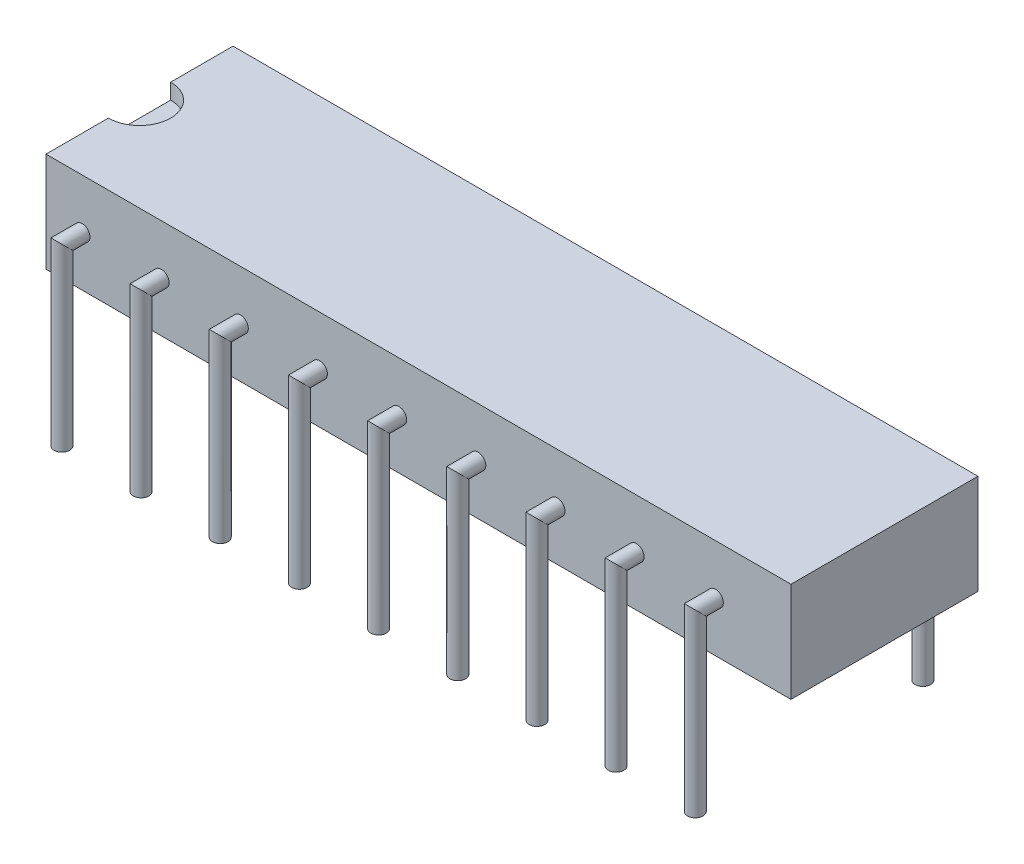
ISO-10303-21;
HEADER;
FILE_DESCRIPTION(('STEP AP214'),'2;1');
FILE_NAME('part.step','',(''),(''),'','','');
FILE_SCHEMA(('AUTOMOTIVE_DESIGN { 1 0 10303 214 1 1 1 1 }'));
ENDSEC;
DATA;
#1=APPLICATION_CONTEXT('core data for automotive mechanical design processes');
#2=APPLICATION_PROTOCOL_DEFINITION('international standard','automotive_design',2000,#1);
#3=PRODUCT_CONTEXT('',#1,'mechanical');
#4=PRODUCT('Part','Part','',(#3));
#5=PRODUCT_RELATED_PRODUCT_CATEGORY('part','',(#4));
#6=PRODUCT_DEFINITION_FORMATION('','',#4);
#7=PRODUCT_DEFINITION_CONTEXT('part definition',#1,'design');
#8=PRODUCT_DEFINITION('design','',#6,#7);
#9=PRODUCT_DEFINITION_SHAPE('','',#8);
#10=(LENGTH_UNIT() NAMED_UNIT(*) SI_UNIT(.MILLI.,.METRE.));
#11=(NAMED_UNIT(*) PLANE_ANGLE_UNIT() SI_UNIT($,.RADIAN.));
#12=(NAMED_UNIT(*) SI_UNIT($,.STERADIAN.) SOLID_ANGLE_UNIT());
#13=UNCERTAINTY_MEASURE_WITH_UNIT(LENGTH_MEASURE(1.E-05),#10,'distance_accuracy_value','');
#14=(GEOMETRIC_REPRESENTATION_CONTEXT(3) GLOBAL_UNCERTAINTY_ASSIGNED_CONTEXT((#13)) GLOBAL_UNIT_ASSIGNED_CONTEXT((#10,
#11,#12)) REPRESENTATION_CONTEXT('',''));
#15=CARTESIAN_POINT('',(0.,0.,0.));
#16=DIRECTION('',(0.,0.,1.));
#17=DIRECTION('',(1.,0.,0.));
#18=AXIS2_PLACEMENT_3D('',#15,#16,#17);
#19=CARTESIAN_POINT('',(23.9,3.2,3.));
#20=DIRECTION('',(0.,0.,-1.));
#21=DIRECTION('',(-1.,0.,0.));
#22=AXIS2_PLACEMENT_3D('',#19,#20,#21);
#23=PLANE('',#22);
#24=CARTESIAN_POINT('',(18.94,1.6,3.));
#25=DIRECTION('',(0.,0.,-1.));
#26=DIRECTION('',(-1.,0.,0.));
#27=AXIS2_PLACEMENT_3D('',#24,#25,#26);
#28=CIRCLE('',#27,0.25);
#29=CARTESIAN_POINT('',(18.69,1.6,3.));
#30=VERTEX_POINT('',#29);
#31=EDGE_CURVE('E56',#30,#30,#28,.F.);
#32=ORIENTED_EDGE('',*,*,#31,.F.);
#33=EDGE_LOOP('',(#32));
#34=FACE_BOUND('',#33,.T.);
#35=CARTESIAN_POINT('',(13.86,1.6,3.));
#36=DIRECTION('',(0.,0.,-1.));
#37=DIRECTION('',(-1.,0.,0.));
#38=AXIS2_PLACEMENT_3D('',#35,#36,#37);
#39=CIRCLE('',#38,0.25);
#40=CARTESIAN_POINT('',(13.61,1.6,3.));
#41=VERTEX_POINT('',#40);
#42=EDGE_CURVE('E162',#41,#41,#39,.F.);
#43=ORIENTED_EDGE('',*,*,#42,.F.);
#44=EDGE_LOOP('',(#43));
#45=FACE_BOUND('',#44,.T.);
#46=CARTESIAN_POINT('',(8.78,1.6,3.));
#47=DIRECTION('',(0.,0.,-1.));
#48=DIRECTION('',(-1.,0.,0.));
#49=AXIS2_PLACEMENT_3D('',#46,#47,#48);
#50=CIRCLE('',#49,0.25);
#51=CARTESIAN_POINT('',(8.53,1.6,3.));
#52=VERTEX_POINT('',#51);
#53=EDGE_CURVE('E156',#52,#52,#50,.F.);
#54=ORIENTED_EDGE('',*,*,#53,.F.);
#55=EDGE_LOOP('',(#54));
#56=FACE_BOUND('',#55,.T.);
#57=CARTESIAN_POINT('',(3.7,1.6,3.));
#58=DIRECTION('',(0.,0.,-1.));
#59=DIRECTION('',(-1.,0.,0.));
#60=AXIS2_PLACEMENT_3D('',#57,#58,#59);
#61=CIRCLE('',#60,0.25);
#62=CARTESIAN_POINT('',(3.45,1.6,3.));
#63=VERTEX_POINT('',#62);
#64=EDGE_CURVE('E150',#63,#63,#61,.F.);
#65=ORIENTED_EDGE('',*,*,#64,.F.);
#66=EDGE_LOOP('',(#65));
#67=FACE_BOUND('',#66,.T.);
#68=DIRECTION('',(0.,-1.,0.));
#69=VECTOR('',#68,1.);
#70=CARTESIAN_POINT('',(0.,3.2,3.));
#71=LINE('',#70,#69);
#72=CARTESIAN_POINT('',(0.,3.2,3.));
#73=VERTEX_POINT('',#72);
#74=CARTESIAN_POINT('',(0.,0.,3.));
#75=VERTEX_POINT('',#74);
#76=EDGE_CURVE('E186',#73,#75,#71,.T.);
#77=ORIENTED_EDGE('',*,*,#76,.T.);
#78=DIRECTION('',(-1.,0.,0.));
#79=VECTOR('',#78,1.);
#80=CARTESIAN_POINT('',(23.9,0.,3.));
#81=LINE('',#80,#79);
#82=CARTESIAN_POINT('',(23.9,0.,3.));
#83=VERTEX_POINT('',#82);
#84=EDGE_CURVE('E144',#83,#75,#81,.T.);
#85=ORIENTED_EDGE('',*,*,#84,.F.);
#86=DIRECTION('',(0.,-1.,0.));
#87=VECTOR('',#86,1.);
#88=CARTESIAN_POINT('',(23.9,3.2,3.));
#89=LINE('',#88,#87);
#90=CARTESIAN_POINT('',(23.9,3.2,3.));
#91=VERTEX_POINT('',#90);
#92=EDGE_CURVE('E124',#91,#83,#89,.T.);
#93=ORIENTED_EDGE('',*,*,#92,.F.);
#94=DIRECTION('',(-1.,0.,0.));
#95=VECTOR('',#94,1.);
#96=CARTESIAN_POINT('',(23.9,3.2,3.));
#97=LINE('',#96,#95);
#98=EDGE_CURVE('E137',#91,#73,#97,.T.);
#99=ORIENTED_EDGE('',*,*,#98,.T.);
#100=EDGE_LOOP('',(#77,#85,#93,#99));
#101=FACE_BOUND('',#100,.T.);
#102=CARTESIAN_POINT('',(1.16,1.6,3.));
#103=DIRECTION('',(0.,0.,-1.));
#104=DIRECTION('',(-1.,0.,0.));
#105=AXIS2_PLACEMENT_3D('',#102,#103,#104);
#106=CIRCLE('',#105,0.25);
#107=CARTESIAN_POINT('',(0.91,1.6,3.));
#108=VERTEX_POINT('',#107);
#109=EDGE_CURVE('E147',#108,#108,#106,.F.);
#110=ORIENTED_EDGE('',*,*,#109,.F.);
#111=EDGE_LOOP('',(#110));
#112=FACE_BOUND('',#111,.T.);
#113=CARTESIAN_POINT('',(6.24,1.6,3.));
#114=DIRECTION('',(0.,0.,-1.));
#115=DIRECTION('',(-1.,0.,0.));
#116=AXIS2_PLACEMENT_3D('',#113,#114,#115);
#117=CIRCLE('',#116,0.25);
#118=CARTESIAN_POINT('',(5.99,1.6,3.));
#119=VERTEX_POINT('',#118);
#120=EDGE_CURVE('E153',#119,#119,#117,.F.);
#121=ORIENTED_EDGE('',*,*,#120,.F.);
#122=EDGE_LOOP('',(#121));
#123=FACE_BOUND('',#122,.T.);
#124=CARTESIAN_POINT('',(11.32,1.6,3.));
#125=DIRECTION('',(0.,0.,-1.));
#126=DIRECTION('',(-1.,0.,0.));
#127=AXIS2_PLACEMENT_3D('',#124,#125,#126);
#128=CIRCLE('',#127,0.25);
#129=CARTESIAN_POINT('',(11.07,1.6,3.));
#130=VERTEX_POINT('',#129);
#131=EDGE_CURVE('E159',#130,#130,#128,.F.);
#132=ORIENTED_EDGE('',*,*,#131,.F.);
#133=EDGE_LOOP('',(#132));
#134=FACE_BOUND('',#133,.T.);
#135=CARTESIAN_POINT('',(16.4,1.6,3.));
#136=DIRECTION('',(0.,0.,-1.));
#137=DIRECTION('',(-1.,0.,0.));
#138=AXIS2_PLACEMENT_3D('',#135,#136,#137);
#139=CIRCLE('',#138,0.25);
#140=CARTESIAN_POINT('',(16.15,1.6,3.));
#141=VERTEX_POINT('',#140);
#142=EDGE_CURVE('E165',#141,#141,#139,.F.);
#143=ORIENTED_EDGE('',*,*,#142,.F.);
#144=EDGE_LOOP('',(#143));
#145=FACE_BOUND('',#144,.T.);
#146=CARTESIAN_POINT('',(21.48,1.6,3.));
#147=DIRECTION('',(0.,0.,-1.));
#148=DIRECTION('',(-1.,0.,0.));
#149=AXIS2_PLACEMENT_3D('',#146,#147,#148);
#150=CIRCLE('',#149,0.25);
#151=CARTESIAN_POINT('',(21.23,1.6,3.));
#152=VERTEX_POINT('',#151);
#153=EDGE_CURVE('E12',#152,#152,#150,.F.);
#154=ORIENTED_EDGE('',*,*,#153,.F.);
#155=EDGE_LOOP('',(#154));
#156=FACE_BOUND('',#155,.T.);
#157=ADVANCED_FACE('F49',(#34,#45,#56,#67,#101,#112,#123,#134,#145,#156),#23,.F.);
#158=CARTESIAN_POINT('',(23.9,0.,3.));
#159=DIRECTION('',(0.,1.,0.));
#160=DIRECTION('',(0.,0.,1.));
#161=AXIS2_PLACEMENT_3D('',#158,#159,#160);
#162=PLANE('',#161);
#163=DIRECTION('',(0.,0.,-1.));
#164=VECTOR('',#163,1.);
#165=CARTESIAN_POINT('',(0.,0.,3.));
#166=LINE('',#165,#164);
#167=CARTESIAN_POINT('',(0.,0.,-3.));
#168=VERTEX_POINT('',#167);
#169=EDGE_CURVE('E276',#75,#168,#166,.T.);
#170=ORIENTED_EDGE('',*,*,#169,.T.);
#171=DIRECTION('',(-1.,0.,0.));
#172=VECTOR('',#171,1.);
#173=CARTESIAN_POINT('',(23.9,0.,-3.));
#174=LINE('',#173,#172);
#175=CARTESIAN_POINT('',(23.9,0.,-3.));
#176=VERTEX_POINT('',#175);
#177=EDGE_CURVE('E141',#176,#168,#174,.T.);
#178=ORIENTED_EDGE('',*,*,#177,.F.);
#179=DIRECTION('',(0.,0.,-1.));
#180=VECTOR('',#179,1.);
#181=CARTESIAN_POINT('',(23.9,0.,3.));
#182=LINE('',#181,#180);
#183=EDGE_CURVE('E127',#83,#176,#182,.T.);
#184=ORIENTED_EDGE('',*,*,#183,.F.);
#185=ORIENTED_EDGE('',*,*,#84,.T.);
#186=EDGE_LOOP('',(#170,#178,#184,#185));
#187=FACE_BOUND('',#186,.T.);
#188=ADVANCED_FACE('F175',(#187),#162,.F.);
#189=CARTESIAN_POINT('',(23.9,3.2,-3.));
#190=DIRECTION('',(0.,0.,1.));
#191=DIRECTION('',(1.,0.,0.));
#192=AXIS2_PLACEMENT_3D('',#189,#190,#191);
#193=PLANE('',#192);
#194=CARTESIAN_POINT('',(21.48,1.6,-3.));
#195=DIRECTION('',(0.,0.,1.));
#196=DIRECTION('',(1.,0.,0.));
#197=AXIS2_PLACEMENT_3D('',#194,#195,#196);
#198=CIRCLE('',#197,0.25);
#199=CARTESIAN_POINT('',(21.73,1.6,-3.));
#200=VERTEX_POINT('',#199);
#201=EDGE_CURVE('E883',#200,#200,#198,.T.);
#202=ORIENTED_EDGE('',*,*,#201,.T.);
#203=EDGE_LOOP('',(#202));
#204=FACE_BOUND('',#203,.T.);
#205=CARTESIAN_POINT('',(18.94,1.6,-3.));
#206=DIRECTION('',(0.,0.,1.));
#207=DIRECTION('',(1.,0.,0.));
#208=AXIS2_PLACEMENT_3D('',#205,#206,#207);
#209=CIRCLE('',#208,0.25);
#210=CARTESIAN_POINT('',(19.19,1.6,-3.));
#211=VERTEX_POINT('',#210);
#212=EDGE_CURVE('E876',#211,#211,#209,.T.);
#213=ORIENTED_EDGE('',*,*,#212,.T.);
#214=EDGE_LOOP('',(#213));
#215=FACE_BOUND('',#214,.T.);
#216=CARTESIAN_POINT('',(16.4,1.6,-3.));
#217=DIRECTION('',(0.,0.,1.));
#218=DIRECTION('',(1.,0.,0.));
#219=AXIS2_PLACEMENT_3D('',#216,#217,#218);
#220=CIRCLE('',#219,0.25);
#221=CARTESIAN_POINT('',(16.65,1.6,-3.));
#222=VERTEX_POINT('',#221);
#223=EDGE_CURVE('E892',#222,#222,#220,.T.);
#224=ORIENTED_EDGE('',*,*,#223,.T.);
#225=EDGE_LOOP('',(#224));
#226=FACE_BOUND('',#225,.T.);
#227=CARTESIAN_POINT('',(13.86,1.6,-3.));
#228=DIRECTION('',(0.,0.,1.));
#229=DIRECTION('',(1.,0.,0.));
#230=AXIS2_PLACEMENT_3D('',#227,#228,#229);
#231=CIRCLE('',#230,0.25);
#232=CARTESIAN_POINT('',(14.11,1.6,-3.));
#233=VERTEX_POINT('',#232);
#234=EDGE_CURVE('E901',#233,#233,#231,.T.);
#235=ORIENTED_EDGE('',*,*,#234,.T.);
#236=EDGE_LOOP('',(#235));
#237=FACE_BOUND('',#236,.T.);
#238=CARTESIAN_POINT('',(11.32,1.6,-3.));
#239=DIRECTION('',(0.,0.,1.));
#240=DIRECTION('',(1.,0.,0.));
#241=AXIS2_PLACEMENT_3D('',#238,#239,#240);
#242=CIRCLE('',#241,0.25);
#243=CARTESIAN_POINT('',(11.57,1.6,-3.));
#244=VERTEX_POINT('',#243);
#245=EDGE_CURVE('E910',#244,#244,#242,.T.);
#246=ORIENTED_EDGE('',*,*,#245,.T.);
#247=EDGE_LOOP('',(#246));
#248=FACE_BOUND('',#247,.T.);
#249=CARTESIAN_POINT('',(8.78,1.6,-3.));
#250=DIRECTION('',(0.,0.,1.));
#251=DIRECTION('',(1.,0.,0.));
#252=AXIS2_PLACEMENT_3D('',#249,#250,#251);
#253=CIRCLE('',#252,0.25);
#254=CARTESIAN_POINT('',(9.03,1.6,-3.));
#255=VERTEX_POINT('',#254);
#256=EDGE_CURVE('E919',#255,#255,#253,.T.);
#257=ORIENTED_EDGE('',*,*,#256,.T.);
#258=EDGE_LOOP('',(#257));
#259=FACE_BOUND('',#258,.T.);
#260=CARTESIAN_POINT('',(6.24,1.6,-3.));
#261=DIRECTION('',(0.,0.,1.));
#262=DIRECTION('',(1.,0.,0.));
#263=AXIS2_PLACEMENT_3D('',#260,#261,#262);
#264=CIRCLE('',#263,0.25);
#265=CARTESIAN_POINT('',(6.49,1.6,-3.));
#266=VERTEX_POINT('',#265);
#267=EDGE_CURVE('E928',#266,#266,#264,.T.);
#268=ORIENTED_EDGE('',*,*,#267,.T.);
#269=EDGE_LOOP('',(#268));
#270=FACE_BOUND('',#269,.T.);
#271=CARTESIAN_POINT('',(3.7,1.6,-3.));
#272=DIRECTION('',(0.,0.,1.));
#273=DIRECTION('',(1.,0.,0.));
#274=AXIS2_PLACEMENT_3D('',#271,#272,#273);
#275=CIRCLE('',#274,0.25);
#276=CARTESIAN_POINT('',(3.95,1.6,-3.));
#277=VERTEX_POINT('',#276);
#278=EDGE_CURVE('E937',#277,#277,#275,.T.);
#279=ORIENTED_EDGE('',*,*,#278,.T.);
#280=EDGE_LOOP('',(#279));
#281=FACE_BOUND('',#280,.T.);
#282=CARTESIAN_POINT('',(1.16,1.6,-3.));
#283=DIRECTION('',(0.,0.,1.));
#284=DIRECTION('',(1.,0.,0.));
#285=AXIS2_PLACEMENT_3D('',#282,#283,#284);
#286=CIRCLE('',#285,0.25);
#287=CARTESIAN_POINT('',(1.41,1.6,-3.));
#288=VERTEX_POINT('',#287);
#289=EDGE_CURVE('E259',#288,#288,#286,.T.);
#290=ORIENTED_EDGE('',*,*,#289,.T.);
#291=EDGE_LOOP('',(#290));
#292=FACE_BOUND('',#291,.T.);
#293=DIRECTION('',(0.,1.,0.));
#294=VECTOR('',#293,1.);
#295=CARTESIAN_POINT('',(0.,3.2,-3.));
#296=LINE('',#295,#294);
#297=CARTESIAN_POINT('',(0.,3.2,-3.));
#298=VERTEX_POINT('',#297);
#299=EDGE_CURVE('E129',#168,#298,#296,.T.);
#300=ORIENTED_EDGE('',*,*,#299,.T.);
#301=DIRECTION('',(-1.,0.,0.));
#302=VECTOR('',#301,1.);
#303=CARTESIAN_POINT('',(23.9,3.2,-3.));
#304=LINE('',#303,#302);
#305=CARTESIAN_POINT('',(23.9,3.2,-3.));
#306=VERTEX_POINT('',#305);
#307=EDGE_CURVE('E123',#306,#298,#304,.T.);
#308=ORIENTED_EDGE('',*,*,#307,.F.);
#309=DIRECTION('',(0.,1.,0.));
#310=VECTOR('',#309,1.);
#311=CARTESIAN_POINT('',(23.9,3.2,-3.));
#312=LINE('',#311,#310);
#313=EDGE_CURVE('E134',#176,#306,#312,.T.);
#314=ORIENTED_EDGE('',*,*,#313,.F.);
#315=ORIENTED_EDGE('',*,*,#177,.T.);
#316=EDGE_LOOP('',(#300,#308,#314,#315));
#317=FACE_BOUND('',#316,.T.);
#318=ADVANCED_FACE('F280',(#204,#215,#226,#237,#248,#259,#270,#281,#292,#317),#193,.F.);
#319=CARTESIAN_POINT('',(23.9,3.2,3.));
#320=DIRECTION('',(0.,-1.,0.));
#321=DIRECTION('',(0.,0.,-1.));
#322=AXIS2_PLACEMENT_3D('',#319,#320,#321);
#323=PLANE('',#322);
#324=DIRECTION('',(0.,0.,1.));
#325=VECTOR('',#324,1.);
#326=CARTESIAN_POINT('',(0.,3.2,3.));
#327=LINE('',#326,#325);
#328=CARTESIAN_POINT('',(0.,3.2,-1.));
#329=VERTEX_POINT('',#328);
#330=EDGE_CURVE('E117',#298,#329,#327,.T.);
#331=ORIENTED_EDGE('',*,*,#330,.T.);
#332=CARTESIAN_POINT('',(0.,3.2,0.));
#333=DIRECTION('',(0.,1.,0.));
#334=DIRECTION('',(0.,0.,1.));
#335=AXIS2_PLACEMENT_3D('',#332,#333,#334);
#336=CIRCLE('',#335,1.);
#337=CARTESIAN_POINT('',(0.,3.2,1.));
#338=VERTEX_POINT('',#337);
#339=EDGE_CURVE('E101',#338,#329,#336,.T.);
#340=ORIENTED_EDGE('',*,*,#339,.F.);
#341=EDGE_CURVE('E125',#338,#73,#327,.T.);
#342=ORIENTED_EDGE('',*,*,#341,.T.);
#343=ORIENTED_EDGE('',*,*,#98,.F.);
#344=DIRECTION('',(0.,0.,1.));
#345=VECTOR('',#344,1.);
#346=CARTESIAN_POINT('',(23.9,3.2,3.));
#347=LINE('',#346,#345);
#348=EDGE_CURVE('E70',#306,#91,#347,.T.);
#349=ORIENTED_EDGE('',*,*,#348,.F.);
#350=ORIENTED_EDGE('',*,*,#307,.T.);
#351=EDGE_LOOP('',(#331,#340,#342,#343,#349,#350));
#352=FACE_BOUND('',#351,.T.);
#353=ADVANCED_FACE('F121',(#352),#323,.F.);
#354=CARTESIAN_POINT('',(23.9,0.,3.));
#355=DIRECTION('',(1.,0.,0.));
#356=DIRECTION('',(0.,0.,-1.));
#357=AXIS2_PLACEMENT_3D('',#354,#355,#356);
#358=PLANE('',#357);
#359=ORIENTED_EDGE('',*,*,#92,.T.);
#360=ORIENTED_EDGE('',*,*,#183,.T.);
#361=ORIENTED_EDGE('',*,*,#313,.T.);
#362=ORIENTED_EDGE('',*,*,#348,.T.);
#363=EDGE_LOOP('',(#359,#360,#361,#362));
#364=FACE_BOUND('',#363,.T.);
#365=ADVANCED_FACE('F283',(#364),#358,.T.);
#366=CARTESIAN_POINT('',(0.,0.,3.));
#367=DIRECTION('',(1.,0.,0.));
#368=DIRECTION('',(0.,0.,-1.));
#369=AXIS2_PLACEMENT_3D('',#366,#367,#368);
#370=PLANE('',#369);
#371=DIRECTION('',(0.,0.,1.));
#372=VECTOR('',#371,1.);
#373=CARTESIAN_POINT('',(0.,2.7,-1.));
#374=LINE('',#373,#372);
#375=CARTESIAN_POINT('',(0.,2.7,-1.));
#376=VERTEX_POINT('',#375);
#377=CARTESIAN_POINT('',(0.,2.7,1.));
#378=VERTEX_POINT('',#377);
#379=EDGE_CURVE('E118',#376,#378,#374,.T.);
#380=ORIENTED_EDGE('',*,*,#379,.F.);
#381=DIRECTION('',(0.,1.,0.));
#382=VECTOR('',#381,1.);
#383=CARTESIAN_POINT('',(0.,2.7,-1.));
#384=LINE('',#383,#382);
#385=EDGE_CURVE('E104',#376,#329,#384,.T.);
#386=ORIENTED_EDGE('',*,*,#385,.T.);
#387=ORIENTED_EDGE('',*,*,#330,.F.);
#388=ORIENTED_EDGE('',*,*,#299,.F.);
#389=ORIENTED_EDGE('',*,*,#169,.F.);
#390=ORIENTED_EDGE('',*,*,#76,.F.);
#391=ORIENTED_EDGE('',*,*,#341,.F.);
#392=DIRECTION('',(0.,1.,0.));
#393=VECTOR('',#392,1.);
#394=CARTESIAN_POINT('',(0.,2.7,1.));
#395=LINE('',#394,#393);
#396=EDGE_CURVE('E107',#378,#338,#395,.T.);
#397=ORIENTED_EDGE('',*,*,#396,.F.);
#398=EDGE_LOOP('',(#380,#386,#387,#388,#389,#390,#391,#397));
#399=FACE_BOUND('',#398,.T.);
#400=ADVANCED_FACE('F115',(#399),#370,.F.);
#401=CARTESIAN_POINT('',(0.,2.7,0.));
#402=DIRECTION('',(0.,1.,0.));
#403=DIRECTION('',(0.,0.,1.));
#404=AXIS2_PLACEMENT_3D('',#401,#402,#403);
#405=CYLINDRICAL_SURFACE('',#404,1.);
#406=ORIENTED_EDGE('',*,*,#339,.T.);
#407=ORIENTED_EDGE('',*,*,#385,.F.);
#408=CARTESIAN_POINT('',(0.,2.7,0.));
#409=DIRECTION('',(0.,1.,0.));
#410=DIRECTION('',(0.,0.,1.));
#411=AXIS2_PLACEMENT_3D('',#408,#409,#410);
#412=CIRCLE('',#411,1.);
#413=EDGE_CURVE('E62',#378,#376,#412,.T.);
#414=ORIENTED_EDGE('',*,*,#413,.F.);
#415=ORIENTED_EDGE('',*,*,#396,.T.);
#416=EDGE_LOOP('',(#406,#407,#414,#415));
#417=FACE_BOUND('',#416,.T.);
#418=ADVANCED_FACE('F103',(#417),#405,.F.);
#419=CARTESIAN_POINT('',(0.,2.7,0.));
#420=DIRECTION('',(0.,1.,0.));
#421=DIRECTION('',(0.,0.,1.));
#422=AXIS2_PLACEMENT_3D('',#419,#420,#421);
#423=PLANE('',#422);
#424=ORIENTED_EDGE('',*,*,#413,.T.);
#425=ORIENTED_EDGE('',*,*,#379,.T.);
#426=EDGE_LOOP('',(#424,#425));
#427=FACE_BOUND('',#426,.T.);
#428=ADVANCED_FACE('F327',(#427),#423,.T.);
#429=CARTESIAN_POINT('',(1.16,1.6,3.65));
#430=DIRECTION('',(0.,-1.,0.));
#431=DIRECTION('',(0.,0.,-1.));
#432=AXIS2_PLACEMENT_3D('',#429,#430,#431);
#433=CYLINDRICAL_SURFACE('',#432,0.25);
#434=CARTESIAN_POINT('',(1.16,1.6,3.65));
#435=DIRECTION('',(0.,-0.707106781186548,0.707106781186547));
#436=DIRECTION('',(0.,-0.707106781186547,-0.707106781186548));
#437=AXIS2_PLACEMENT_3D('',#434,#435,#436);
#438=ELLIPSE('',#437,0.353553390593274,0.25);
#439=CARTESIAN_POINT('',(1.16,1.35,3.4));
#440=VERTEX_POINT('',#439);
#441=EDGE_CURVE('E268',#440,#440,#438,.T.);
#442=ORIENTED_EDGE('',*,*,#441,.T.);
#443=EDGE_LOOP('',(#442));
#444=FACE_BOUND('',#443,.T.);
#445=CARTESIAN_POINT('',(1.16,-4.,3.65));
#446=DIRECTION('',(0.,-1.,0.));
#447=DIRECTION('',(0.,0.,-1.));
#448=AXIS2_PLACEMENT_3D('',#445,#446,#447);
#449=CIRCLE('',#448,0.25);
#450=CARTESIAN_POINT('',(1.16,-4.,3.4));
#451=VERTEX_POINT('',#450);
#452=EDGE_CURVE('E111',#451,#451,#449,.F.);
#453=ORIENTED_EDGE('',*,*,#452,.T.);
#454=EDGE_LOOP('',(#453));
#455=FACE_BOUND('',#454,.T.);
#456=ADVANCED_FACE('F335',(#444,#455),#433,.T.);
#457=CARTESIAN_POINT('',(1.16,1.6,4.35710678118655));
#458=DIRECTION('',(0.,0.,-1.));
#459=DIRECTION('',(0.,1.,0.));
#460=AXIS2_PLACEMENT_3D('',#457,#458,#459);
#461=CYLINDRICAL_SURFACE('',#460,0.25);
#462=ORIENTED_EDGE('',*,*,#109,.T.);
#463=EDGE_LOOP('',(#462));
#464=FACE_BOUND('',#463,.T.);
#465=ORIENTED_EDGE('',*,*,#441,.F.);
#466=EDGE_LOOP('',(#465));
#467=FACE_BOUND('',#466,.T.);
#468=ADVANCED_FACE('F344',(#464,#467),#461,.T.);
#469=CARTESIAN_POINT('',(1.16,-4.,3.65));
#470=DIRECTION('',(0.,-1.,0.));
#471=DIRECTION('',(0.,0.,-1.));
#472=AXIS2_PLACEMENT_3D('',#469,#470,#471);
#473=PLANE('',#472);
#474=ORIENTED_EDGE('',*,*,#452,.F.);
#475=EDGE_LOOP('',(#474));
#476=FACE_BOUND('',#475,.T.);
#477=ADVANCED_FACE('F354',(#476),#473,.T.);
#478=CARTESIAN_POINT('',(1.16,1.6,-3.65));
#479=DIRECTION('',(0.,-1.,0.));
#480=DIRECTION('',(0.,0.,-1.));
#481=AXIS2_PLACEMENT_3D('',#478,#479,#480);
#482=CYLINDRICAL_SURFACE('',#481,0.25);
#483=CARTESIAN_POINT('',(1.16,1.6,-3.65));
#484=DIRECTION('',(0.,-0.707106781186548,-0.707106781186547));
#485=DIRECTION('',(0.,-0.707106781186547,0.707106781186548));
#486=AXIS2_PLACEMENT_3D('',#483,#484,#485);
#487=ELLIPSE('',#486,0.353553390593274,0.25);
#488=CARTESIAN_POINT('',(1.16,1.35,-3.4));
#489=VERTEX_POINT('',#488);
#490=EDGE_CURVE('E262',#489,#489,#487,.F.);
#491=ORIENTED_EDGE('',*,*,#490,.F.);
#492=EDGE_LOOP('',(#491));
#493=FACE_BOUND('',#492,.T.);
#494=CARTESIAN_POINT('',(1.16,-4.,-3.65));
#495=DIRECTION('',(0.,-1.,0.));
#496=DIRECTION('',(0.,0.,-1.));
#497=AXIS2_PLACEMENT_3D('',#494,#495,#496);
#498=CIRCLE('',#497,0.25);
#499=CARTESIAN_POINT('',(1.16,-4.,-3.9));
#500=VERTEX_POINT('',#499);
#501=EDGE_CURVE('E265',#500,#500,#498,.T.);
#502=ORIENTED_EDGE('',*,*,#501,.F.);
#503=EDGE_LOOP('',(#502));
#504=FACE_BOUND('',#503,.T.);
#505=ADVANCED_FACE('F364',(#493,#504),#482,.T.);
#506=CARTESIAN_POINT('',(1.16,1.6,-4.35710678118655));
#507=DIRECTION('',(0.,0.,1.));
#508=DIRECTION('',(0.,-1.,0.));
#509=AXIS2_PLACEMENT_3D('',#506,#507,#508);
#510=CYLINDRICAL_SURFACE('',#509,0.25);
#511=ORIENTED_EDGE('',*,*,#289,.F.);
#512=EDGE_LOOP('',(#511));
#513=FACE_BOUND('',#512,.T.);
#514=ORIENTED_EDGE('',*,*,#490,.T.);
#515=EDGE_LOOP('',(#514));
#516=FACE_BOUND('',#515,.T.);
#517=ADVANCED_FACE('F374',(#513,#516),#510,.T.);
#518=CARTESIAN_POINT('',(1.16,-4.,-3.65));
#519=DIRECTION('',(0.,-1.,0.));
#520=DIRECTION('',(0.,0.,-1.));
#521=AXIS2_PLACEMENT_3D('',#518,#519,#520);
#522=PLANE('',#521);
#523=ORIENTED_EDGE('',*,*,#501,.T.);
#524=EDGE_LOOP('',(#523));
#525=FACE_BOUND('',#524,.T.);
#526=ADVANCED_FACE('F384',(#525),#522,.T.);
#527=CARTESIAN_POINT('',(3.7,1.6,3.65));
#528=DIRECTION('',(0.,-1.,0.));
#529=DIRECTION('',(0.,0.,-1.));
#530=AXIS2_PLACEMENT_3D('',#527,#528,#529);
#531=CYLINDRICAL_SURFACE('',#530,0.25);
#532=CARTESIAN_POINT('',(3.7,1.6,3.65));
#533=DIRECTION('',(0.,-0.707106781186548,0.707106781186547));
#534=DIRECTION('',(0.,-0.707106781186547,-0.707106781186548));
#535=AXIS2_PLACEMENT_3D('',#532,#533,#534);
#536=ELLIPSE('',#535,0.353553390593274,0.25);
#537=CARTESIAN_POINT('',(3.7,1.35,3.4));
#538=VERTEX_POINT('',#537);
#539=EDGE_CURVE('E253',#538,#538,#536,.T.);
#540=ORIENTED_EDGE('',*,*,#539,.T.);
#541=EDGE_LOOP('',(#540));
#542=FACE_BOUND('',#541,.T.);
#543=CARTESIAN_POINT('',(3.7,-4.,3.65));
#544=DIRECTION('',(0.,-1.,0.));
#545=DIRECTION('',(0.,0.,-1.));
#546=AXIS2_PLACEMENT_3D('',#543,#544,#545);
#547=CIRCLE('',#546,0.25);
#548=CARTESIAN_POINT('',(3.7,-4.,3.4));
#549=VERTEX_POINT('',#548);
#550=EDGE_CURVE('E256',#549,#549,#547,.F.);
#551=ORIENTED_EDGE('',*,*,#550,.T.);
#552=EDGE_LOOP('',(#551));
#553=FACE_BOUND('',#552,.T.);
#554=ADVANCED_FACE('F393',(#542,#553),#531,.T.);
#555=CARTESIAN_POINT('',(3.7,1.6,4.35710678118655));
#556=DIRECTION('',(0.,0.,-1.));
#557=DIRECTION('',(0.,1.,0.));
#558=AXIS2_PLACEMENT_3D('',#555,#556,#557);
#559=CYLINDRICAL_SURFACE('',#558,0.25);
#560=ORIENTED_EDGE('',*,*,#64,.T.);
#561=EDGE_LOOP('',(#560));
#562=FACE_BOUND('',#561,.T.);
#563=ORIENTED_EDGE('',*,*,#539,.F.);
#564=EDGE_LOOP('',(#563));
#565=FACE_BOUND('',#564,.T.);
#566=ADVANCED_FACE('F408',(#562,#565),#559,.T.);
#567=CARTESIAN_POINT('',(3.7,-4.,3.65));
#568=DIRECTION('',(0.,-1.,0.));
#569=DIRECTION('',(0.,0.,-1.));
#570=AXIS2_PLACEMENT_3D('',#567,#568,#569);
#571=PLANE('',#570);
#572=ORIENTED_EDGE('',*,*,#550,.F.);
#573=EDGE_LOOP('',(#572));
#574=FACE_BOUND('',#573,.T.);
#575=ADVANCED_FACE('F417',(#574),#571,.T.);
#576=CARTESIAN_POINT('',(6.24,1.6,3.65));
#577=DIRECTION('',(0.,-1.,0.));
#578=DIRECTION('',(0.,0.,-1.));
#579=AXIS2_PLACEMENT_3D('',#576,#577,#578);
#580=CYLINDRICAL_SURFACE('',#579,0.25);
#581=CARTESIAN_POINT('',(6.24,1.6,3.65));
#582=DIRECTION('',(0.,-0.707106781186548,0.707106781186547));
#583=DIRECTION('',(0.,-0.707106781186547,-0.707106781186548));
#584=AXIS2_PLACEMENT_3D('',#581,#582,#583);
#585=ELLIPSE('',#584,0.353553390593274,0.25);
#586=CARTESIAN_POINT('',(6.24,1.35,3.4));
#587=VERTEX_POINT('',#586);
#588=EDGE_CURVE('E247',#587,#587,#585,.T.);
#589=ORIENTED_EDGE('',*,*,#588,.T.);
#590=EDGE_LOOP('',(#589));
#591=FACE_BOUND('',#590,.T.);
#592=CARTESIAN_POINT('',(6.24,-4.,3.65));
#593=DIRECTION('',(0.,-1.,0.));
#594=DIRECTION('',(0.,0.,-1.));
#595=AXIS2_PLACEMENT_3D('',#592,#593,#594);
#596=CIRCLE('',#595,0.25);
#597=CARTESIAN_POINT('',(6.24,-4.,3.4));
#598=VERTEX_POINT('',#597);
#599=EDGE_CURVE('E250',#598,#598,#596,.F.);
#600=ORIENTED_EDGE('',*,*,#599,.T.);
#601=EDGE_LOOP('',(#600));
#602=FACE_BOUND('',#601,.T.);
#603=ADVANCED_FACE('F426',(#591,#602),#580,.T.);
#604=CARTESIAN_POINT('',(6.24,1.6,4.35710678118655));
#605=DIRECTION('',(0.,0.,-1.));
#606=DIRECTION('',(0.,1.,0.));
#607=AXIS2_PLACEMENT_3D('',#604,#605,#606);
#608=CYLINDRICAL_SURFACE('',#607,0.25);
#609=ORIENTED_EDGE('',*,*,#120,.T.);
#610=EDGE_LOOP('',(#609));
#611=FACE_BOUND('',#610,.T.);
#612=ORIENTED_EDGE('',*,*,#588,.F.);
#613=EDGE_LOOP('',(#612));
#614=FACE_BOUND('',#613,.T.);
#615=ADVANCED_FACE('F435',(#611,#614),#608,.T.);
#616=CARTESIAN_POINT('',(6.24,-4.,3.65));
#617=DIRECTION('',(0.,-1.,0.));
#618=DIRECTION('',(0.,0.,-1.));
#619=AXIS2_PLACEMENT_3D('',#616,#617,#618);
#620=PLANE('',#619);
#621=ORIENTED_EDGE('',*,*,#599,.F.);
#622=EDGE_LOOP('',(#621));
#623=FACE_BOUND('',#622,.T.);
#624=ADVANCED_FACE('F444',(#623),#620,.T.);
#625=CARTESIAN_POINT('',(8.78,1.6,3.65));
#626=DIRECTION('',(0.,-1.,0.));
#627=DIRECTION('',(0.,0.,-1.));
#628=AXIS2_PLACEMENT_3D('',#625,#626,#627);
#629=CYLINDRICAL_SURFACE('',#628,0.25);
#630=CARTESIAN_POINT('',(8.78,1.6,3.65));
#631=DIRECTION('',(0.,-0.707106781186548,0.707106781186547));
#632=DIRECTION('',(0.,-0.707106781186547,-0.707106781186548));
#633=AXIS2_PLACEMENT_3D('',#630,#631,#632);
#634=ELLIPSE('',#633,0.353553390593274,0.25);
#635=CARTESIAN_POINT('',(8.78,1.35,3.4));
#636=VERTEX_POINT('',#635);
#637=EDGE_CURVE('E241',#636,#636,#634,.T.);
#638=ORIENTED_EDGE('',*,*,#637,.T.);
#639=EDGE_LOOP('',(#638));
#640=FACE_BOUND('',#639,.T.);
#641=CARTESIAN_POINT('',(8.78,-4.,3.65));
#642=DIRECTION('',(0.,-1.,0.));
#643=DIRECTION('',(0.,0.,-1.));
#644=AXIS2_PLACEMENT_3D('',#641,#642,#643);
#645=CIRCLE('',#644,0.25);
#646=CARTESIAN_POINT('',(8.78,-4.,3.4));
#647=VERTEX_POINT('',#646);
#648=EDGE_CURVE('E244',#647,#647,#645,.F.);
#649=ORIENTED_EDGE('',*,*,#648,.T.);
#650=EDGE_LOOP('',(#649));
#651=FACE_BOUND('',#650,.T.);
#652=ADVANCED_FACE('F453',(#640,#651),#629,.T.);
#653=CARTESIAN_POINT('',(8.78,1.6,4.35710678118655));
#654=DIRECTION('',(0.,0.,-1.));
#655=DIRECTION('',(0.,1.,0.));
#656=AXIS2_PLACEMENT_3D('',#653,#654,#655);
#657=CYLINDRICAL_SURFACE('',#656,0.25);
#658=ORIENTED_EDGE('',*,*,#53,.T.);
#659=EDGE_LOOP('',(#658));
#660=FACE_BOUND('',#659,.T.);
#661=ORIENTED_EDGE('',*,*,#637,.F.);
#662=EDGE_LOOP('',(#661));
#663=FACE_BOUND('',#662,.T.);
#664=ADVANCED_FACE('F462',(#660,#663),#657,.T.);
#665=CARTESIAN_POINT('',(8.78,-4.,3.65));
#666=DIRECTION('',(0.,-1.,0.));
#667=DIRECTION('',(0.,0.,-1.));
#668=AXIS2_PLACEMENT_3D('',#665,#666,#667);
#669=PLANE('',#668);
#670=ORIENTED_EDGE('',*,*,#648,.F.);
#671=EDGE_LOOP('',(#670));
#672=FACE_BOUND('',#671,.T.);
#673=ADVANCED_FACE('F471',(#672),#669,.T.);
#674=CARTESIAN_POINT('',(11.32,1.6,3.65));
#675=DIRECTION('',(0.,-1.,0.));
#676=DIRECTION('',(0.,0.,-1.));
#677=AXIS2_PLACEMENT_3D('',#674,#675,#676);
#678=CYLINDRICAL_SURFACE('',#677,0.25);
#679=CARTESIAN_POINT('',(11.32,1.6,3.65));
#680=DIRECTION('',(0.,-0.707106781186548,0.707106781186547));
#681=DIRECTION('',(0.,-0.707106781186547,-0.707106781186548));
#682=AXIS2_PLACEMENT_3D('',#679,#680,#681);
#683=ELLIPSE('',#682,0.353553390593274,0.25);
#684=CARTESIAN_POINT('',(11.32,1.35,3.4));
#685=VERTEX_POINT('',#684);
#686=EDGE_CURVE('E235',#685,#685,#683,.T.);
#687=ORIENTED_EDGE('',*,*,#686,.T.);
#688=EDGE_LOOP('',(#687));
#689=FACE_BOUND('',#688,.T.);
#690=CARTESIAN_POINT('',(11.32,-4.,3.65));
#691=DIRECTION('',(0.,-1.,0.));
#692=DIRECTION('',(0.,0.,-1.));
#693=AXIS2_PLACEMENT_3D('',#690,#691,#692);
#694=CIRCLE('',#693,0.25);
#695=CARTESIAN_POINT('',(11.32,-4.,3.4));
#696=VERTEX_POINT('',#695);
#697=EDGE_CURVE('E238',#696,#696,#694,.F.);
#698=ORIENTED_EDGE('',*,*,#697,.T.);
#699=EDGE_LOOP('',(#698));
#700=FACE_BOUND('',#699,.T.);
#701=ADVANCED_FACE('F480',(#689,#700),#678,.T.);
#702=CARTESIAN_POINT('',(11.32,1.6,4.35710678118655));
#703=DIRECTION('',(0.,0.,-1.));
#704=DIRECTION('',(0.,1.,0.));
#705=AXIS2_PLACEMENT_3D('',#702,#703,#704);
#706=CYLINDRICAL_SURFACE('',#705,0.25);
#707=ORIENTED_EDGE('',*,*,#131,.T.);
#708=EDGE_LOOP('',(#707));
#709=FACE_BOUND('',#708,.T.);
#710=ORIENTED_EDGE('',*,*,#686,.F.);
#711=EDGE_LOOP('',(#710));
#712=FACE_BOUND('',#711,.T.);
#713=ADVANCED_FACE('F489',(#709,#712),#706,.T.);
#714=CARTESIAN_POINT('',(11.32,-4.,3.65));
#715=DIRECTION('',(0.,-1.,0.));
#716=DIRECTION('',(0.,0.,-1.));
#717=AXIS2_PLACEMENT_3D('',#714,#715,#716);
#718=PLANE('',#717);
#719=ORIENTED_EDGE('',*,*,#697,.F.);
#720=EDGE_LOOP('',(#719));
#721=FACE_BOUND('',#720,.T.);
#722=ADVANCED_FACE('F498',(#721),#718,.T.);
#723=CARTESIAN_POINT('',(13.86,1.6,3.65));
#724=DIRECTION('',(0.,-1.,0.));
#725=DIRECTION('',(0.,0.,-1.));
#726=AXIS2_PLACEMENT_3D('',#723,#724,#725);
#727=CYLINDRICAL_SURFACE('',#726,0.25);
#728=CARTESIAN_POINT('',(13.86,1.6,3.65));
#729=DIRECTION('',(0.,-0.707106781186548,0.707106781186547));
#730=DIRECTION('',(0.,-0.707106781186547,-0.707106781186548));
#731=AXIS2_PLACEMENT_3D('',#728,#729,#730);
#732=ELLIPSE('',#731,0.353553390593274,0.25);
#733=CARTESIAN_POINT('',(13.86,1.35,3.4));
#734=VERTEX_POINT('',#733);
#735=EDGE_CURVE('E229',#734,#734,#732,.T.);
#736=ORIENTED_EDGE('',*,*,#735,.T.);
#737=EDGE_LOOP('',(#736));
#738=FACE_BOUND('',#737,.T.);
#739=CARTESIAN_POINT('',(13.86,-4.,3.65));
#740=DIRECTION('',(0.,-1.,0.));
#741=DIRECTION('',(0.,0.,-1.));
#742=AXIS2_PLACEMENT_3D('',#739,#740,#741);
#743=CIRCLE('',#742,0.25);
#744=CARTESIAN_POINT('',(13.86,-4.,3.4));
#745=VERTEX_POINT('',#744);
#746=EDGE_CURVE('E232',#745,#745,#743,.F.);
#747=ORIENTED_EDGE('',*,*,#746,.T.);
#748=EDGE_LOOP('',(#747));
#749=FACE_BOUND('',#748,.T.);
#750=ADVANCED_FACE('F507',(#738,#749),#727,.T.);
#751=CARTESIAN_POINT('',(13.86,1.6,4.35710678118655));
#752=DIRECTION('',(0.,0.,-1.));
#753=DIRECTION('',(0.,1.,0.));
#754=AXIS2_PLACEMENT_3D('',#751,#752,#753);
#755=CYLINDRICAL_SURFACE('',#754,0.25);
#756=ORIENTED_EDGE('',*,*,#42,.T.);
#757=EDGE_LOOP('',(#756));
#758=FACE_BOUND('',#757,.T.);
#759=ORIENTED_EDGE('',*,*,#735,.F.);
#760=EDGE_LOOP('',(#759));
#761=FACE_BOUND('',#760,.T.);
#762=ADVANCED_FACE('F516',(#758,#761),#755,.T.);
#763=CARTESIAN_POINT('',(13.86,-4.,3.65));
#764=DIRECTION('',(0.,-1.,0.));
#765=DIRECTION('',(0.,0.,-1.));
#766=AXIS2_PLACEMENT_3D('',#763,#764,#765);
#767=PLANE('',#766);
#768=ORIENTED_EDGE('',*,*,#746,.F.);
#769=EDGE_LOOP('',(#768));
#770=FACE_BOUND('',#769,.T.);
#771=ADVANCED_FACE('F525',(#770),#767,.T.);
#772=CARTESIAN_POINT('',(16.4,1.6,3.65));
#773=DIRECTION('',(0.,-1.,0.));
#774=DIRECTION('',(0.,0.,-1.));
#775=AXIS2_PLACEMENT_3D('',#772,#773,#774);
#776=CYLINDRICAL_SURFACE('',#775,0.25);
#777=CARTESIAN_POINT('',(16.4,1.6,3.65));
#778=DIRECTION('',(0.,-0.707106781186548,0.707106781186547));
#779=DIRECTION('',(0.,-0.707106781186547,-0.707106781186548));
#780=AXIS2_PLACEMENT_3D('',#777,#778,#779);
#781=ELLIPSE('',#780,0.353553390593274,0.25);
#782=CARTESIAN_POINT('',(16.4,1.35,3.4));
#783=VERTEX_POINT('',#782);
#784=EDGE_CURVE('E223',#783,#783,#781,.T.);
#785=ORIENTED_EDGE('',*,*,#784,.T.);
#786=EDGE_LOOP('',(#785));
#787=FACE_BOUND('',#786,.T.);
#788=CARTESIAN_POINT('',(16.4,-4.,3.65));
#789=DIRECTION('',(0.,-1.,0.));
#790=DIRECTION('',(0.,0.,-1.));
#791=AXIS2_PLACEMENT_3D('',#788,#789,#790);
#792=CIRCLE('',#791,0.25);
#793=CARTESIAN_POINT('',(16.4,-4.,3.4));
#794=VERTEX_POINT('',#793);
#795=EDGE_CURVE('E226',#794,#794,#792,.F.);
#796=ORIENTED_EDGE('',*,*,#795,.T.);
#797=EDGE_LOOP('',(#796));
#798=FACE_BOUND('',#797,.T.);
#799=ADVANCED_FACE('F534',(#787,#798),#776,.T.);
#800=CARTESIAN_POINT('',(16.4,1.6,4.35710678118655));
#801=DIRECTION('',(0.,0.,-1.));
#802=DIRECTION('',(0.,1.,0.));
#803=AXIS2_PLACEMENT_3D('',#800,#801,#802);
#804=CYLINDRICAL_SURFACE('',#803,0.25);
#805=ORIENTED_EDGE('',*,*,#142,.T.);
#806=EDGE_LOOP('',(#805));
#807=FACE_BOUND('',#806,.T.);
#808=ORIENTED_EDGE('',*,*,#784,.F.);
#809=EDGE_LOOP('',(#808));
#810=FACE_BOUND('',#809,.T.);
#811=ADVANCED_FACE('F543',(#807,#810),#804,.T.);
#812=CARTESIAN_POINT('',(16.4,-4.,3.65));
#813=DIRECTION('',(0.,-1.,0.));
#814=DIRECTION('',(0.,0.,-1.));
#815=AXIS2_PLACEMENT_3D('',#812,#813,#814);
#816=PLANE('',#815);
#817=ORIENTED_EDGE('',*,*,#795,.F.);
#818=EDGE_LOOP('',(#817));
#819=FACE_BOUND('',#818,.T.);
#820=ADVANCED_FACE('F552',(#819),#816,.T.);
#821=CARTESIAN_POINT('',(18.94,1.6,3.65));
#822=DIRECTION('',(0.,-1.,0.));
#823=DIRECTION('',(0.,0.,-1.));
#824=AXIS2_PLACEMENT_3D('',#821,#822,#823);
#825=CYLINDRICAL_SURFACE('',#824,0.25);
#826=CARTESIAN_POINT('',(18.94,1.6,3.65));
#827=DIRECTION('',(0.,-0.707106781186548,0.707106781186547));
#828=DIRECTION('',(0.,-0.707106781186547,-0.707106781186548));
#829=AXIS2_PLACEMENT_3D('',#826,#827,#828);
#830=ELLIPSE('',#829,0.353553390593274,0.25);
#831=CARTESIAN_POINT('',(18.94,1.35,3.4));
#832=VERTEX_POINT('',#831);
#833=EDGE_CURVE('E211',#832,#832,#830,.T.);
#834=ORIENTED_EDGE('',*,*,#833,.T.);
#835=EDGE_LOOP('',(#834));
#836=FACE_BOUND('',#835,.T.);
#837=CARTESIAN_POINT('',(18.94,-4.,3.65));
#838=DIRECTION('',(0.,-1.,0.));
#839=DIRECTION('',(0.,0.,-1.));
#840=AXIS2_PLACEMENT_3D('',#837,#838,#839);
#841=CIRCLE('',#840,0.25);
#842=CARTESIAN_POINT('',(18.94,-4.,3.4));
#843=VERTEX_POINT('',#842);
#844=EDGE_CURVE('E220',#843,#843,#841,.F.);
#845=ORIENTED_EDGE('',*,*,#844,.T.);
#846=EDGE_LOOP('',(#845));
#847=FACE_BOUND('',#846,.T.);
#848=ADVANCED_FACE('F561',(#836,#847),#825,.T.);
#849=CARTESIAN_POINT('',(18.94,1.6,4.35710678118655));
#850=DIRECTION('',(0.,0.,-1.));
#851=DIRECTION('',(0.,1.,0.));
#852=AXIS2_PLACEMENT_3D('',#849,#850,#851);
#853=CYLINDRICAL_SURFACE('',#852,0.25);
#854=ORIENTED_EDGE('',*,*,#31,.T.);
#855=EDGE_LOOP('',(#854));
#856=FACE_BOUND('',#855,.T.);
#857=ORIENTED_EDGE('',*,*,#833,.F.);
#858=EDGE_LOOP('',(#857));
#859=FACE_BOUND('',#858,.T.);
#860=ADVANCED_FACE('F170',(#856,#859),#853,.T.);
#861=CARTESIAN_POINT('',(18.94,-4.,3.65));
#862=DIRECTION('',(0.,-1.,0.));
#863=DIRECTION('',(0.,0.,-1.));
#864=AXIS2_PLACEMENT_3D('',#861,#862,#863);
#865=PLANE('',#864);
#866=ORIENTED_EDGE('',*,*,#844,.F.);
#867=EDGE_LOOP('',(#866));
#868=FACE_BOUND('',#867,.T.);
#869=ADVANCED_FACE('F578',(#868),#865,.T.);
#870=CARTESIAN_POINT('',(21.48,1.6,3.65));
#871=DIRECTION('',(0.,-1.,0.));
#872=DIRECTION('',(0.,0.,-1.));
#873=AXIS2_PLACEMENT_3D('',#870,#871,#872);
#874=CYLINDRICAL_SURFACE('',#873,0.25);
#875=CARTESIAN_POINT('',(21.48,1.6,3.65));
#876=DIRECTION('',(0.,-0.707106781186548,0.707106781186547));
#877=DIRECTION('',(0.,-0.707106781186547,-0.707106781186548));
#878=AXIS2_PLACEMENT_3D('',#875,#876,#877);
#879=ELLIPSE('',#878,0.353553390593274,0.25);
#880=CARTESIAN_POINT('',(21.48,1.35,3.4));
#881=VERTEX_POINT('',#880);
#882=EDGE_CURVE('E205',#881,#881,#879,.T.);
#883=ORIENTED_EDGE('',*,*,#882,.T.);
#884=EDGE_LOOP('',(#883));
#885=FACE_BOUND('',#884,.T.);
#886=CARTESIAN_POINT('',(21.48,-4.,3.65));
#887=DIRECTION('',(0.,-1.,0.));
#888=DIRECTION('',(0.,0.,-1.));
#889=AXIS2_PLACEMENT_3D('',#886,#887,#888);
#890=CIRCLE('',#889,0.25);
#891=CARTESIAN_POINT('',(21.48,-4.,3.4));
#892=VERTEX_POINT('',#891);
#893=EDGE_CURVE('E207',#892,#892,#890,.F.);
#894=ORIENTED_EDGE('',*,*,#893,.T.);
#895=EDGE_LOOP('',(#894));
#896=FACE_BOUND('',#895,.T.);
#897=ADVANCED_FACE('F201',(#885,#896),#874,.T.);
#898=CARTESIAN_POINT('',(21.48,1.6,4.35710678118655));
#899=DIRECTION('',(0.,0.,-1.));
#900=DIRECTION('',(0.,1.,0.));
#901=AXIS2_PLACEMENT_3D('',#898,#899,#900);
#902=CYLINDRICAL_SURFACE('',#901,0.25);
#903=ORIENTED_EDGE('',*,*,#153,.T.);
#904=EDGE_LOOP('',(#903));
#905=FACE_BOUND('',#904,.T.);
#906=ORIENTED_EDGE('',*,*,#882,.F.);
#907=EDGE_LOOP('',(#906));
#908=FACE_BOUND('',#907,.T.);
#909=ADVANCED_FACE('F197',(#905,#908),#902,.T.);
#910=CARTESIAN_POINT('',(21.48,-4.,3.65));
#911=DIRECTION('',(0.,-1.,0.));
#912=DIRECTION('',(0.,0.,-1.));
#913=AXIS2_PLACEMENT_3D('',#910,#911,#912);
#914=PLANE('',#913);
#915=ORIENTED_EDGE('',*,*,#893,.F.);
#916=EDGE_LOOP('',(#915));
#917=FACE_BOUND('',#916,.T.);
#918=ADVANCED_FACE('F200',(#917),#914,.T.);
#919=CARTESIAN_POINT('',(3.7,1.6,-3.65));
#920=DIRECTION('',(0.,-1.,0.));
#921=DIRECTION('',(0.,0.,-1.));
#922=AXIS2_PLACEMENT_3D('',#919,#920,#921);
#923=CYLINDRICAL_SURFACE('',#922,0.25);
#924=CARTESIAN_POINT('',(3.7,1.6,-3.65));
#925=DIRECTION('',(0.,-0.707106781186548,-0.707106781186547));
#926=DIRECTION('',(0.,-0.707106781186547,0.707106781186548));
#927=AXIS2_PLACEMENT_3D('',#924,#925,#926);
#928=ELLIPSE('',#927,0.353553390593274,0.25);
#929=CARTESIAN_POINT('',(3.7,1.35,-3.4));
#930=VERTEX_POINT('',#929);
#931=EDGE_CURVE('E214',#930,#930,#928,.F.);
#932=ORIENTED_EDGE('',*,*,#931,.F.);
#933=EDGE_LOOP('',(#932));
#934=FACE_BOUND('',#933,.T.);
#935=CARTESIAN_POINT('',(3.7,-4.,-3.65));
#936=DIRECTION('',(0.,-1.,0.));
#937=DIRECTION('',(0.,0.,-1.));
#938=AXIS2_PLACEMENT_3D('',#935,#936,#937);
#939=CIRCLE('',#938,0.25);
#940=CARTESIAN_POINT('',(3.7,-4.,-3.9));
#941=VERTEX_POINT('',#940);
#942=EDGE_CURVE('E208',#941,#941,#939,.T.);
#943=ORIENTED_EDGE('',*,*,#942,.F.);
#944=EDGE_LOOP('',(#943));
#945=FACE_BOUND('',#944,.T.);
#946=ADVANCED_FACE('F606',(#934,#945),#923,.T.);
#947=CARTESIAN_POINT('',(3.7,1.6,-4.35710678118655));
#948=DIRECTION('',(0.,0.,1.));
#949=DIRECTION('',(0.,-1.,0.));
#950=AXIS2_PLACEMENT_3D('',#947,#948,#949);
#951=CYLINDRICAL_SURFACE('',#950,0.25);
#952=ORIENTED_EDGE('',*,*,#278,.F.);
#953=EDGE_LOOP('',(#952));
#954=FACE_BOUND('',#953,.T.);
#955=ORIENTED_EDGE('',*,*,#931,.T.);
#956=EDGE_LOOP('',(#955));
#957=FACE_BOUND('',#956,.T.);
#958=ADVANCED_FACE('F615',(#954,#957),#951,.T.);
#959=CARTESIAN_POINT('',(3.7,-4.,-3.65));
#960=DIRECTION('',(0.,-1.,0.));
#961=DIRECTION('',(0.,0.,-1.));
#962=AXIS2_PLACEMENT_3D('',#959,#960,#961);
#963=PLANE('',#962);
#964=ORIENTED_EDGE('',*,*,#942,.T.);
#965=EDGE_LOOP('',(#964));
#966=FACE_BOUND('',#965,.T.);
#967=ADVANCED_FACE('F624',(#966),#963,.T.);
#968=CARTESIAN_POINT('',(6.24,1.6,-3.65));
#969=DIRECTION('',(0.,-1.,0.));
#970=DIRECTION('',(0.,0.,-1.));
#971=AXIS2_PLACEMENT_3D('',#968,#969,#970);
#972=CYLINDRICAL_SURFACE('',#971,0.25);
#973=CARTESIAN_POINT('',(6.24,1.6,-3.65));
#974=DIRECTION('',(0.,-0.707106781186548,-0.707106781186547));
#975=DIRECTION('',(0.,-0.707106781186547,0.707106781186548));
#976=AXIS2_PLACEMENT_3D('',#973,#974,#975);
#977=ELLIPSE('',#976,0.353553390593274,0.25);
#978=CARTESIAN_POINT('',(6.24,1.35,-3.4));
#979=VERTEX_POINT('',#978);
#980=EDGE_CURVE('E931',#979,#979,#977,.F.);
#981=ORIENTED_EDGE('',*,*,#980,.F.);
#982=EDGE_LOOP('',(#981));
#983=FACE_BOUND('',#982,.T.);
#984=CARTESIAN_POINT('',(6.24,-4.,-3.65));
#985=DIRECTION('',(0.,-1.,0.));
#986=DIRECTION('',(0.,0.,-1.));
#987=AXIS2_PLACEMENT_3D('',#984,#985,#986);
#988=CIRCLE('',#987,0.25);
#989=CARTESIAN_POINT('',(6.24,-4.,-3.9));
#990=VERTEX_POINT('',#989);
#991=EDGE_CURVE('E934',#990,#990,#988,.T.);
#992=ORIENTED_EDGE('',*,*,#991,.F.);
#993=EDGE_LOOP('',(#992));
#994=FACE_BOUND('',#993,.T.);
#995=ADVANCED_FACE('F633',(#983,#994),#972,.T.);
#996=CARTESIAN_POINT('',(6.24,1.6,-4.35710678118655));
#997=DIRECTION('',(0.,0.,1.));
#998=DIRECTION('',(0.,-1.,0.));
#999=AXIS2_PLACEMENT_3D('',#996,#997,#998);
#1000=CYLINDRICAL_SURFACE('',#999,0.25);
#1001=ORIENTED_EDGE('',*,*,#267,.F.);
#1002=EDGE_LOOP('',(#1001));
#1003=FACE_BOUND('',#1002,.T.);
#1004=ORIENTED_EDGE('',*,*,#980,.T.);
#1005=EDGE_LOOP('',(#1004));
#1006=FACE_BOUND('',#1005,.T.);
#1007=ADVANCED_FACE('F642',(#1003,#1006),#1000,.T.);
#1008=CARTESIAN_POINT('',(6.24,-4.,-3.65));
#1009=DIRECTION('',(0.,-1.,0.));
#1010=DIRECTION('',(0.,0.,-1.));
#1011=AXIS2_PLACEMENT_3D('',#1008,#1009,#1010);
#1012=PLANE('',#1011);
#1013=ORIENTED_EDGE('',*,*,#991,.T.);
#1014=EDGE_LOOP('',(#1013));
#1015=FACE_BOUND('',#1014,.T.);
#1016=ADVANCED_FACE('F651',(#1015),#1012,.T.);
#1017=CARTESIAN_POINT('',(8.78,1.6,-3.65));
#1018=DIRECTION('',(0.,-1.,0.));
#1019=DIRECTION('',(0.,0.,-1.));
#1020=AXIS2_PLACEMENT_3D('',#1017,#1018,#1019);
#1021=CYLINDRICAL_SURFACE('',#1020,0.25);
#1022=CARTESIAN_POINT('',(8.78,1.6,-3.65));
#1023=DIRECTION('',(0.,-0.707106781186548,-0.707106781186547));
#1024=DIRECTION('',(0.,-0.707106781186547,0.707106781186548));
#1025=AXIS2_PLACEMENT_3D('',#1022,#1023,#1024);
#1026=ELLIPSE('',#1025,0.353553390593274,0.25);
#1027=CARTESIAN_POINT('',(8.78,1.35,-3.4));
#1028=VERTEX_POINT('',#1027);
#1029=EDGE_CURVE('E922',#1028,#1028,#1026,.F.);
#1030=ORIENTED_EDGE('',*,*,#1029,.F.);
#1031=EDGE_LOOP('',(#1030));
#1032=FACE_BOUND('',#1031,.T.);
#1033=CARTESIAN_POINT('',(8.78,-4.,-3.65));
#1034=DIRECTION('',(0.,-1.,0.));
#1035=DIRECTION('',(0.,0.,-1.));
#1036=AXIS2_PLACEMENT_3D('',#1033,#1034,#1035);
#1037=CIRCLE('',#1036,0.25);
#1038=CARTESIAN_POINT('',(8.78,-4.,-3.9));
#1039=VERTEX_POINT('',#1038);
#1040=EDGE_CURVE('E925',#1039,#1039,#1037,.T.);
#1041=ORIENTED_EDGE('',*,*,#1040,.F.);
#1042=EDGE_LOOP('',(#1041));
#1043=FACE_BOUND('',#1042,.T.);
#1044=ADVANCED_FACE('F660',(#1032,#1043),#1021,.T.);
#1045=CARTESIAN_POINT('',(8.78,1.6,-4.35710678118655));
#1046=DIRECTION('',(0.,0.,1.));
#1047=DIRECTION('',(0.,-1.,0.));
#1048=AXIS2_PLACEMENT_3D('',#1045,#1046,#1047);
#1049=CYLINDRICAL_SURFACE('',#1048,0.25);
#1050=ORIENTED_EDGE('',*,*,#256,.F.);
#1051=EDGE_LOOP('',(#1050));
#1052=FACE_BOUND('',#1051,.T.);
#1053=ORIENTED_EDGE('',*,*,#1029,.T.);
#1054=EDGE_LOOP('',(#1053));
#1055=FACE_BOUND('',#1054,.T.);
#1056=ADVANCED_FACE('F669',(#1052,#1055),#1049,.T.);
#1057=CARTESIAN_POINT('',(8.78,-4.,-3.65));
#1058=DIRECTION('',(0.,-1.,0.));
#1059=DIRECTION('',(0.,0.,-1.));
#1060=AXIS2_PLACEMENT_3D('',#1057,#1058,#1059);
#1061=PLANE('',#1060);
#1062=ORIENTED_EDGE('',*,*,#1040,.T.);
#1063=EDGE_LOOP('',(#1062));
#1064=FACE_BOUND('',#1063,.T.);
#1065=ADVANCED_FACE('F678',(#1064),#1061,.T.);
#1066=CARTESIAN_POINT('',(11.32,1.6,-3.65));
#1067=DIRECTION('',(0.,-1.,0.));
#1068=DIRECTION('',(0.,0.,-1.));
#1069=AXIS2_PLACEMENT_3D('',#1066,#1067,#1068);
#1070=CYLINDRICAL_SURFACE('',#1069,0.25);
#1071=CARTESIAN_POINT('',(11.32,1.6,-3.65));
#1072=DIRECTION('',(0.,-0.707106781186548,-0.707106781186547));
#1073=DIRECTION('',(0.,-0.707106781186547,0.707106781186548));
#1074=AXIS2_PLACEMENT_3D('',#1071,#1072,#1073);
#1075=ELLIPSE('',#1074,0.353553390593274,0.25);
#1076=CARTESIAN_POINT('',(11.32,1.35,-3.4));
#1077=VERTEX_POINT('',#1076);
#1078=EDGE_CURVE('E913',#1077,#1077,#1075,.F.);
#1079=ORIENTED_EDGE('',*,*,#1078,.F.);
#1080=EDGE_LOOP('',(#1079));
#1081=FACE_BOUND('',#1080,.T.);
#1082=CARTESIAN_POINT('',(11.32,-4.,-3.65));
#1083=DIRECTION('',(0.,-1.,0.));
#1084=DIRECTION('',(0.,0.,-1.));
#1085=AXIS2_PLACEMENT_3D('',#1082,#1083,#1084);
#1086=CIRCLE('',#1085,0.25);
#1087=CARTESIAN_POINT('',(11.32,-4.,-3.9));
#1088=VERTEX_POINT('',#1087);
#1089=EDGE_CURVE('E916',#1088,#1088,#1086,.T.);
#1090=ORIENTED_EDGE('',*,*,#1089,.F.);
#1091=EDGE_LOOP('',(#1090));
#1092=FACE_BOUND('',#1091,.T.);
#1093=ADVANCED_FACE('F687',(#1081,#1092),#1070,.T.);
#1094=CARTESIAN_POINT('',(11.32,1.6,-4.35710678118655));
#1095=DIRECTION('',(0.,0.,1.));
#1096=DIRECTION('',(0.,-1.,0.));
#1097=AXIS2_PLACEMENT_3D('',#1094,#1095,#1096);
#1098=CYLINDRICAL_SURFACE('',#1097,0.25);
#1099=ORIENTED_EDGE('',*,*,#245,.F.);
#1100=EDGE_LOOP('',(#1099));
#1101=FACE_BOUND('',#1100,.T.);
#1102=ORIENTED_EDGE('',*,*,#1078,.T.);
#1103=EDGE_LOOP('',(#1102));
#1104=FACE_BOUND('',#1103,.T.);
#1105=ADVANCED_FACE('F696',(#1101,#1104),#1098,.T.);
#1106=CARTESIAN_POINT('',(11.32,-4.,-3.65));
#1107=DIRECTION('',(0.,-1.,0.));
#1108=DIRECTION('',(0.,0.,-1.));
#1109=AXIS2_PLACEMENT_3D('',#1106,#1107,#1108);
#1110=PLANE('',#1109);
#1111=ORIENTED_EDGE('',*,*,#1089,.T.);
#1112=EDGE_LOOP('',(#1111));
#1113=FACE_BOUND('',#1112,.T.);
#1114=ADVANCED_FACE('F705',(#1113),#1110,.T.);
#1115=CARTESIAN_POINT('',(13.86,1.6,-3.65));
#1116=DIRECTION('',(0.,-1.,0.));
#1117=DIRECTION('',(0.,0.,-1.));
#1118=AXIS2_PLACEMENT_3D('',#1115,#1116,#1117);
#1119=CYLINDRICAL_SURFACE('',#1118,0.25);
#1120=CARTESIAN_POINT('',(13.86,1.6,-3.65));
#1121=DIRECTION('',(0.,-0.707106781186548,-0.707106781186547));
#1122=DIRECTION('',(0.,-0.707106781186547,0.707106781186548));
#1123=AXIS2_PLACEMENT_3D('',#1120,#1121,#1122);
#1124=ELLIPSE('',#1123,0.353553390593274,0.25);
#1125=CARTESIAN_POINT('',(13.86,1.35,-3.4));
#1126=VERTEX_POINT('',#1125);
#1127=EDGE_CURVE('E904',#1126,#1126,#1124,.F.);
#1128=ORIENTED_EDGE('',*,*,#1127,.F.);
#1129=EDGE_LOOP('',(#1128));
#1130=FACE_BOUND('',#1129,.T.);
#1131=CARTESIAN_POINT('',(13.86,-4.,-3.65));
#1132=DIRECTION('',(0.,-1.,0.));
#1133=DIRECTION('',(0.,0.,-1.));
#1134=AXIS2_PLACEMENT_3D('',#1131,#1132,#1133);
#1135=CIRCLE('',#1134,0.25);
#1136=CARTESIAN_POINT('',(13.86,-4.,-3.9));
#1137=VERTEX_POINT('',#1136);
#1138=EDGE_CURVE('E907',#1137,#1137,#1135,.T.);
#1139=ORIENTED_EDGE('',*,*,#1138,.F.);
#1140=EDGE_LOOP('',(#1139));
#1141=FACE_BOUND('',#1140,.T.);
#1142=ADVANCED_FACE('F714',(#1130,#1141),#1119,.T.);
#1143=CARTESIAN_POINT('',(13.86,1.6,-4.35710678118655));
#1144=DIRECTION('',(0.,0.,1.));
#1145=DIRECTION('',(0.,-1.,0.));
#1146=AXIS2_PLACEMENT_3D('',#1143,#1144,#1145);
#1147=CYLINDRICAL_SURFACE('',#1146,0.25);
#1148=ORIENTED_EDGE('',*,*,#234,.F.);
#1149=EDGE_LOOP('',(#1148));
#1150=FACE_BOUND('',#1149,.T.);
#1151=ORIENTED_EDGE('',*,*,#1127,.T.);
#1152=EDGE_LOOP('',(#1151));
#1153=FACE_BOUND('',#1152,.T.);
#1154=ADVANCED_FACE('F723',(#1150,#1153),#1147,.T.);
#1155=CARTESIAN_POINT('',(13.86,-4.,-3.65));
#1156=DIRECTION('',(0.,-1.,0.));
#1157=DIRECTION('',(0.,0.,-1.));
#1158=AXIS2_PLACEMENT_3D('',#1155,#1156,#1157);
#1159=PLANE('',#1158);
#1160=ORIENTED_EDGE('',*,*,#1138,.T.);
#1161=EDGE_LOOP('',(#1160));
#1162=FACE_BOUND('',#1161,.T.);
#1163=ADVANCED_FACE('F732',(#1162),#1159,.T.);
#1164=CARTESIAN_POINT('',(16.4,1.6,-3.65));
#1165=DIRECTION('',(0.,-1.,0.));
#1166=DIRECTION('',(0.,0.,-1.));
#1167=AXIS2_PLACEMENT_3D('',#1164,#1165,#1166);
#1168=CYLINDRICAL_SURFACE('',#1167,0.25);
#1169=CARTESIAN_POINT('',(16.4,1.6,-3.65));
#1170=DIRECTION('',(0.,-0.707106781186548,-0.707106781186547));
#1171=DIRECTION('',(0.,-0.707106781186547,0.707106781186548));
#1172=AXIS2_PLACEMENT_3D('',#1169,#1170,#1171);
#1173=ELLIPSE('',#1172,0.353553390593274,0.25);
#1174=CARTESIAN_POINT('',(16.4,1.35,-3.4));
#1175=VERTEX_POINT('',#1174);
#1176=EDGE_CURVE('E895',#1175,#1175,#1173,.F.);
#1177=ORIENTED_EDGE('',*,*,#1176,.F.);
#1178=EDGE_LOOP('',(#1177));
#1179=FACE_BOUND('',#1178,.T.);
#1180=CARTESIAN_POINT('',(16.4,-4.,-3.65));
#1181=DIRECTION('',(0.,-1.,0.));
#1182=DIRECTION('',(0.,0.,-1.));
#1183=AXIS2_PLACEMENT_3D('',#1180,#1181,#1182);
#1184=CIRCLE('',#1183,0.25);
#1185=CARTESIAN_POINT('',(16.4,-4.,-3.9));
#1186=VERTEX_POINT('',#1185);
#1187=EDGE_CURVE('E898',#1186,#1186,#1184,.T.);
#1188=ORIENTED_EDGE('',*,*,#1187,.F.);
#1189=EDGE_LOOP('',(#1188));
#1190=FACE_BOUND('',#1189,.T.);
#1191=ADVANCED_FACE('F741',(#1179,#1190),#1168,.T.);
#1192=CARTESIAN_POINT('',(16.4,1.6,-4.35710678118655));
#1193=DIRECTION('',(0.,0.,1.));
#1194=DIRECTION('',(0.,-1.,0.));
#1195=AXIS2_PLACEMENT_3D('',#1192,#1193,#1194);
#1196=CYLINDRICAL_SURFACE('',#1195,0.25);
#1197=ORIENTED_EDGE('',*,*,#223,.F.);
#1198=EDGE_LOOP('',(#1197));
#1199=FACE_BOUND('',#1198,.T.);
#1200=ORIENTED_EDGE('',*,*,#1176,.T.);
#1201=EDGE_LOOP('',(#1200));
#1202=FACE_BOUND('',#1201,.T.);
#1203=ADVANCED_FACE('F750',(#1199,#1202),#1196,.T.);
#1204=CARTESIAN_POINT('',(16.4,-4.,-3.65));
#1205=DIRECTION('',(0.,-1.,0.));
#1206=DIRECTION('',(0.,0.,-1.));
#1207=AXIS2_PLACEMENT_3D('',#1204,#1205,#1206);
#1208=PLANE('',#1207);
#1209=ORIENTED_EDGE('',*,*,#1187,.T.);
#1210=EDGE_LOOP('',(#1209));
#1211=FACE_BOUND('',#1210,.T.);
#1212=ADVANCED_FACE('F759',(#1211),#1208,.T.);
#1213=CARTESIAN_POINT('',(18.94,1.6,-3.65));
#1214=DIRECTION('',(0.,-1.,0.));
#1215=DIRECTION('',(0.,0.,-1.));
#1216=AXIS2_PLACEMENT_3D('',#1213,#1214,#1215);
#1217=CYLINDRICAL_SURFACE('',#1216,0.25);
#1218=CARTESIAN_POINT('',(18.94,1.6,-3.65));
#1219=DIRECTION('',(0.,-0.707106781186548,-0.707106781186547));
#1220=DIRECTION('',(0.,-0.707106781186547,0.707106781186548));
#1221=AXIS2_PLACEMENT_3D('',#1218,#1219,#1220);
#1222=ELLIPSE('',#1221,0.353553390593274,0.25);
#1223=CARTESIAN_POINT('',(18.94,1.35,-3.4));
#1224=VERTEX_POINT('',#1223);
#1225=EDGE_CURVE('E880',#1224,#1224,#1222,.F.);
#1226=ORIENTED_EDGE('',*,*,#1225,.F.);
#1227=EDGE_LOOP('',(#1226));
#1228=FACE_BOUND('',#1227,.T.);
#1229=CARTESIAN_POINT('',(18.94,-4.,-3.65));
#1230=DIRECTION('',(0.,-1.,0.));
#1231=DIRECTION('',(0.,0.,-1.));
#1232=AXIS2_PLACEMENT_3D('',#1229,#1230,#1231);
#1233=CIRCLE('',#1232,0.25);
#1234=CARTESIAN_POINT('',(18.94,-4.,-3.9));
#1235=VERTEX_POINT('',#1234);
#1236=EDGE_CURVE('E889',#1235,#1235,#1233,.T.);
#1237=ORIENTED_EDGE('',*,*,#1236,.F.);
#1238=EDGE_LOOP('',(#1237));
#1239=FACE_BOUND('',#1238,.T.);
#1240=ADVANCED_FACE('F768',(#1228,#1239),#1217,.T.);
#1241=CARTESIAN_POINT('',(18.94,1.6,-4.35710678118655));
#1242=DIRECTION('',(0.,0.,1.));
#1243=DIRECTION('',(0.,-1.,0.));
#1244=AXIS2_PLACEMENT_3D('',#1241,#1242,#1243);
#1245=CYLINDRICAL_SURFACE('',#1244,0.25);
#1246=ORIENTED_EDGE('',*,*,#212,.F.);
#1247=EDGE_LOOP('',(#1246));
#1248=FACE_BOUND('',#1247,.T.);
#1249=ORIENTED_EDGE('',*,*,#1225,.T.);
#1250=EDGE_LOOP('',(#1249));
#1251=FACE_BOUND('',#1250,.T.);
#1252=ADVANCED_FACE('F777',(#1248,#1251),#1245,.T.);
#1253=CARTESIAN_POINT('',(18.94,-4.,-3.65));
#1254=DIRECTION('',(0.,-1.,0.));
#1255=DIRECTION('',(0.,0.,-1.));
#1256=AXIS2_PLACEMENT_3D('',#1253,#1254,#1255);
#1257=PLANE('',#1256);
#1258=ORIENTED_EDGE('',*,*,#1236,.T.);
#1259=EDGE_LOOP('',(#1258));
#1260=FACE_BOUND('',#1259,.T.);
#1261=ADVANCED_FACE('F786',(#1260),#1257,.T.);
#1262=CARTESIAN_POINT('',(21.48,1.6,-3.65));
#1263=DIRECTION('',(0.,-1.,0.));
#1264=DIRECTION('',(0.,0.,-1.));
#1265=AXIS2_PLACEMENT_3D('',#1262,#1263,#1264);
#1266=CYLINDRICAL_SURFACE('',#1265,0.25);
#1267=CARTESIAN_POINT('',(21.48,1.6,-3.65));
#1268=DIRECTION('',(0.,-0.707106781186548,-0.707106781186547));
#1269=DIRECTION('',(0.,-0.707106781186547,0.707106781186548));
#1270=AXIS2_PLACEMENT_3D('',#1267,#1268,#1269);
#1271=ELLIPSE('',#1270,0.353553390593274,0.25);
#1272=CARTESIAN_POINT('',(21.48,1.35,-3.4));
#1273=VERTEX_POINT('',#1272);
#1274=EDGE_CURVE('E877',#1273,#1273,#1271,.F.);
#1275=ORIENTED_EDGE('',*,*,#1274,.F.);
#1276=EDGE_LOOP('',(#1275));
#1277=FACE_BOUND('',#1276,.T.);
#1278=CARTESIAN_POINT('',(21.48,-4.,-3.65));
#1279=DIRECTION('',(0.,-1.,0.));
#1280=DIRECTION('',(0.,0.,-1.));
#1281=AXIS2_PLACEMENT_3D('',#1278,#1279,#1280);
#1282=CIRCLE('',#1281,0.25);
#1283=CARTESIAN_POINT('',(21.48,-4.,-3.9));
#1284=VERTEX_POINT('',#1283);
#1285=EDGE_CURVE('E874',#1284,#1284,#1282,.T.);
#1286=ORIENTED_EDGE('',*,*,#1285,.F.);
#1287=EDGE_LOOP('',(#1286));
#1288=FACE_BOUND('',#1287,.T.);
#1289=ADVANCED_FACE('F795',(#1277,#1288),#1266,.T.);
#1290=CARTESIAN_POINT('',(21.48,1.6,-4.35710678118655));
#1291=DIRECTION('',(0.,0.,1.));
#1292=DIRECTION('',(0.,-1.,0.));
#1293=AXIS2_PLACEMENT_3D('',#1290,#1291,#1292);
#1294=CYLINDRICAL_SURFACE('',#1293,0.25);
#1295=ORIENTED_EDGE('',*,*,#201,.F.);
#1296=EDGE_LOOP('',(#1295));
#1297=FACE_BOUND('',#1296,.T.);
#1298=ORIENTED_EDGE('',*,*,#1274,.T.);
#1299=EDGE_LOOP('',(#1298));
#1300=FACE_BOUND('',#1299,.T.);
#1301=ADVANCED_FACE('F804',(#1297,#1300),#1294,.T.);
#1302=CARTESIAN_POINT('',(21.48,-4.,-3.65));
#1303=DIRECTION('',(0.,-1.,0.));
#1304=DIRECTION('',(0.,0.,-1.));
#1305=AXIS2_PLACEMENT_3D('',#1302,#1303,#1304);
#1306=PLANE('',#1305);
#1307=ORIENTED_EDGE('',*,*,#1285,.T.);
#1308=EDGE_LOOP('',(#1307));
#1309=FACE_BOUND('',#1308,.T.);
#1310=ADVANCED_FACE('F813',(#1309),#1306,.T.);
#1311=CLOSED_SHELL('',(#157,#188,#318,#353,#365,#400,#418,#428,#456,#468,#477,#505,#517,#526,
#554,#566,#575,#603,#615,#624,#652,#664,#673,#701,#713,#722,#750,#762,#771,#799,#811,#820,#848,
#860,#869,#897,#909,#918,#946,#958,#967,#995,#1007,#1016,#1044,#1056,#1065,#1093,#1105,#1114,
#1142,#1154,#1163,#1191,#1203,#1212,#1240,#1252,#1261,#1289,#1301,#1310));
#1312=MANIFOLD_SOLID_BREP('B2',#1311);
#1313=ADVANCED_BREP_SHAPE_REPRESENTATION('',(#18,#1312),#14);
#1314=SHAPE_DEFINITION_REPRESENTATION(#9,#1313);
ENDSEC;
END-ISO-10303-21;
